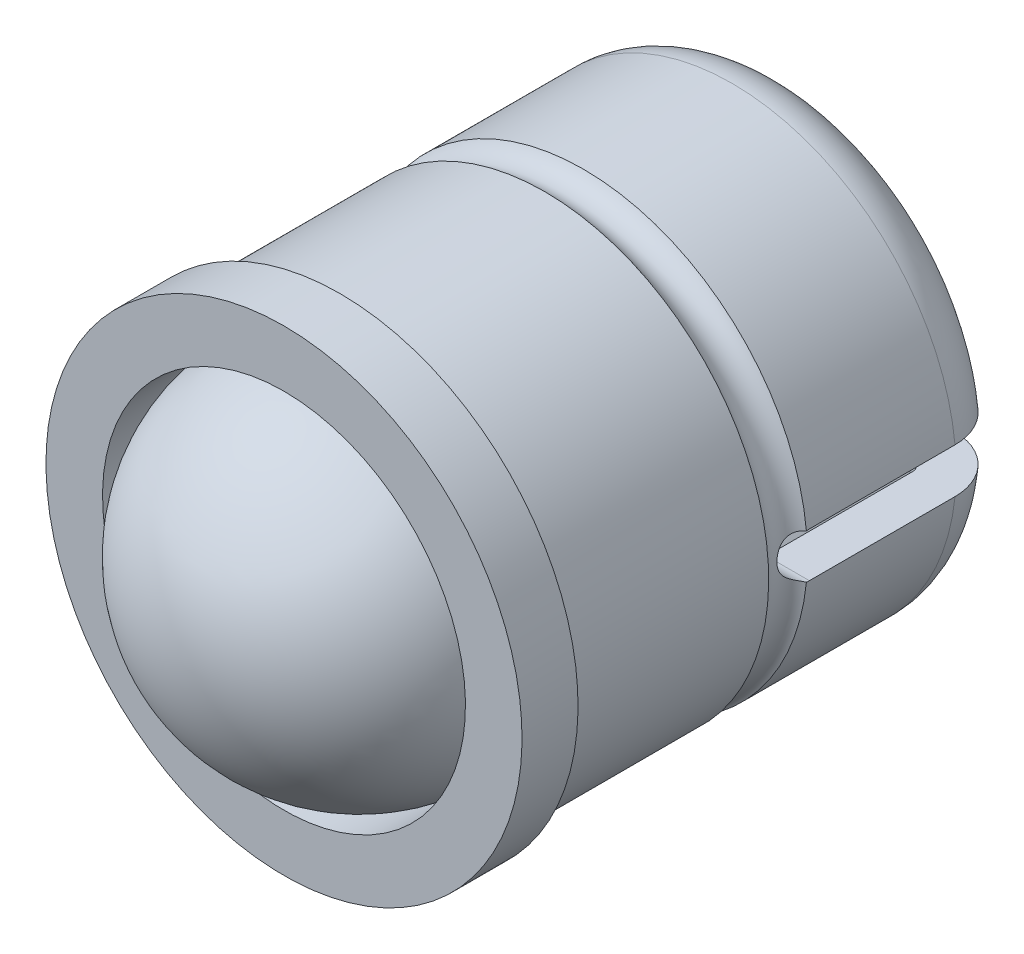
ISO-10303-21;
HEADER;
FILE_DESCRIPTION(('STEP AP214'),'2;1');
FILE_NAME('part.step','',(''),(''),'','','');
FILE_SCHEMA(('AUTOMOTIVE_DESIGN { 1 0 10303 214 1 1 1 1 }'));
ENDSEC;
DATA;
#1=APPLICATION_CONTEXT('core data for automotive mechanical design processes');
#2=APPLICATION_PROTOCOL_DEFINITION('international standard','automotive_design',2000,#1);
#3=PRODUCT_CONTEXT('',#1,'mechanical');
#4=PRODUCT('Part','Part','',(#3));
#5=PRODUCT_RELATED_PRODUCT_CATEGORY('part','',(#4));
#6=PRODUCT_DEFINITION_FORMATION('','',#4);
#7=PRODUCT_DEFINITION_CONTEXT('part definition',#1,'design');
#8=PRODUCT_DEFINITION('design','',#6,#7);
#9=PRODUCT_DEFINITION_SHAPE('','',#8);
#10=(LENGTH_UNIT() NAMED_UNIT(*) SI_UNIT(.MILLI.,.METRE.));
#11=(NAMED_UNIT(*) PLANE_ANGLE_UNIT() SI_UNIT($,.RADIAN.));
#12=(NAMED_UNIT(*) SI_UNIT($,.STERADIAN.) SOLID_ANGLE_UNIT());
#13=UNCERTAINTY_MEASURE_WITH_UNIT(LENGTH_MEASURE(1.E-05),#10,'distance_accuracy_value','');
#14=(GEOMETRIC_REPRESENTATION_CONTEXT(3) GLOBAL_UNCERTAINTY_ASSIGNED_CONTEXT((#13)) GLOBAL_UNIT_ASSIGNED_CONTEXT((#10,
#11,#12)) REPRESENTATION_CONTEXT('',''));
#15=CARTESIAN_POINT('',(0.,0.,0.));
#16=DIRECTION('',(0.,0.,1.));
#17=DIRECTION('',(1.,0.,0.));
#18=AXIS2_PLACEMENT_3D('',#15,#16,#17);
#19=CARTESIAN_POINT('',(0.,0.,1.));
#20=DIRECTION('',(0.,0.,-1.));
#21=DIRECTION('',(0.,1.,0.));
#22=AXIS2_PLACEMENT_3D('',#19,#20,#21);
#23=CYLINDRICAL_SURFACE('',#22,3.24);
#24=CARTESIAN_POINT('',(0.,0.,-7.));
#25=DIRECTION('',(0.,0.,-1.));
#26=DIRECTION('',(0.,1.,0.));
#27=AXIS2_PLACEMENT_3D('',#24,#25,#26);
#28=CIRCLE('',#27,3.24);
#29=CARTESIAN_POINT('',(-3.21521383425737,-0.4,-7.));
#30=VERTEX_POINT('',#29);
#31=CARTESIAN_POINT('',(3.21521383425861,-0.4,-6.99999999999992));
#32=VERTEX_POINT('',#31);
#33=EDGE_CURVE('E402',#30,#32,#28,.F.);
#34=ORIENTED_EDGE('',*,*,#33,.F.);
#35=DIRECTION('',(0.,0.,1.));
#36=VECTOR('',#35,1.);
#37=CARTESIAN_POINT('',(-3.21521383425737,-0.4,-4.4));
#38=LINE('',#37,#36);
#39=CARTESIAN_POINT('',(-3.21521383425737,-0.4,-4.4));
#40=VERTEX_POINT('',#39);
#41=EDGE_CURVE('E303',#40,#30,#38,.F.);
#42=ORIENTED_EDGE('',*,*,#41,.F.);
#43=CARTESIAN_POINT('',(-3.21521383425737,0.4,-4.4));
#44=CARTESIAN_POINT('',(-3.21520473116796,0.400019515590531,-4.37758775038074));
#45=CARTESIAN_POINT('',(-3.21544792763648,0.39811755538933,-4.35518315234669));
#46=CARTESIAN_POINT('',(-3.2163712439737,0.390616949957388,-4.31103385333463));
#47=CARTESIAN_POINT('',(-3.21705090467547,0.385022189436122,-4.28928848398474));
#48=CARTESIAN_POINT('',(-3.21878002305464,0.370279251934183,-4.24704556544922));
#49=CARTESIAN_POINT('',(-3.21982960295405,0.361129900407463,-4.22654843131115));
#50=CARTESIAN_POINT('',(-3.22217708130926,0.339548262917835,-4.1873814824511));
#51=CARTESIAN_POINT('',(-3.22347495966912,0.32711624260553,-4.1687115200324));
#52=CARTESIAN_POINT('',(-3.22618130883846,0.299249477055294,-4.13362795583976));
#53=CARTESIAN_POINT('',(-3.22759027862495,0.283800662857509,-4.11722556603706));
#54=CARTESIAN_POINT('',(-3.2303555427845,0.250367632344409,-4.08723750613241));
#55=CARTESIAN_POINT('',(-3.23171182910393,0.232383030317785,-4.07365226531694));
#56=CARTESIAN_POINT('',(-3.23422396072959,0.194318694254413,-4.04964570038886));
#57=CARTESIAN_POINT('',(-3.23537915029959,0.17423243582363,-4.03923464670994));
#58=CARTESIAN_POINT('',(-3.23735330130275,0.132581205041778,-4.0219383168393));
#59=CARTESIAN_POINT('',(-3.23817229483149,0.111016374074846,-4.01505270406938));
#60=CARTESIAN_POINT('',(-3.23937831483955,0.0671355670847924,-4.00503582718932));
#61=CARTESIAN_POINT('',(-3.23976751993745,0.0448239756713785,-4.00188562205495));
#62=CARTESIAN_POINT('',(-3.24007755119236,-1.4889975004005E-05,-3.9993702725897));
#63=CARTESIAN_POINT('',(-3.23999838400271,-0.0225421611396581,-4.00000507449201));
#64=CARTESIAN_POINT('',(-3.23938233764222,-0.0670428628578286,-4.00502666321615));
#65=CARTESIAN_POINT('',(-3.23884795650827,-0.0890186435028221,-4.00939297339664));
#66=CARTESIAN_POINT('',(-3.23738434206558,-0.131923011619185,-4.02172160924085));
#67=CARTESIAN_POINT('',(-3.23645510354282,-0.152851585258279,-4.02968398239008));
#68=CARTESIAN_POINT('',(-3.23430186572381,-0.193131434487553,-4.04900072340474));
#69=CARTESIAN_POINT('',(-3.2330770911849,-0.212478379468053,-4.06036403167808));
#70=CARTESIAN_POINT('',(-3.2304699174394,-0.248997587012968,-4.08615304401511));
#71=CARTESIAN_POINT('',(-3.22908751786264,-0.266169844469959,-4.10057875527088));
#72=CARTESIAN_POINT('',(-3.22630904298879,-0.29797132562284,-4.13219575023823));
#73=CARTESIAN_POINT('',(-3.22491293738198,-0.312583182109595,-4.14940450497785));
#74=CARTESIAN_POINT('',(-3.22227303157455,-0.338717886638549,-4.18604526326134));
#75=CARTESIAN_POINT('',(-3.22102927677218,-0.350239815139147,-4.20547792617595));
#76=CARTESIAN_POINT('',(-3.21883426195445,-0.369869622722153,-4.24603620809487));
#77=CARTESIAN_POINT('',(-3.21788329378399,-0.377974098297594,-4.26716349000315));
#78=CARTESIAN_POINT('',(-3.21638805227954,-0.390499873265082,-4.31046798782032));
#79=CARTESIAN_POINT('',(-3.21584316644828,-0.394926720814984,-4.33264356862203));
#80=CARTESIAN_POINT('',(-3.21531834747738,-0.399156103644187,-4.36995817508));
#81=CARTESIAN_POINT('',(-3.21521073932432,-0.40000737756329,-4.38498258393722));
#82=CARTESIAN_POINT('',(-3.21521383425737,-0.4,-4.4));
#83=B_SPLINE_CURVE_WITH_KNOTS('',3,(#43,#44,#45,#46,#47,#48,#49,#50,#51,#52,#53,#54,#55,#56,#57,
#58,#59,#60,#61,#62,#63,#64,#65,#66,#67,#68,#69,#70,#71,#72,#73,#74,#75,#76,#77,#78,#79,#80,#81,
#82),.UNSPECIFIED.,.F.,.F.,(4,2,2,2,2,2,2,2,2,2,2,2,2,2,2,2,2,2,2,4),(0.,0.0671435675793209,
0.134216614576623,0.201311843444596,0.268401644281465,0.335812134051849,0.403232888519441,
0.470869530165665,0.53849971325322,0.605785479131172,0.673070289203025,0.739988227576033,
0.806907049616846,0.874003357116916,0.941099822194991,1.0086351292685,1.07619051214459,
1.14381301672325,1.2113333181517,1.25638017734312),.UNSPECIFIED.);
#84=CARTESIAN_POINT('',(-3.21521383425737,0.4,-4.4));
#85=VERTEX_POINT('',#84);
#86=EDGE_CURVE('E183',#85,#40,#83,.T.);
#87=ORIENTED_EDGE('',*,*,#86,.F.);
#88=DIRECTION('',(0.,0.,-1.));
#89=VECTOR('',#88,1.);
#90=CARTESIAN_POINT('',(-3.21521383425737,0.4,-8.));
#91=LINE('',#90,#89);
#92=CARTESIAN_POINT('',(-3.21521383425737,0.4,-7.));
#93=VERTEX_POINT('',#92);
#94=EDGE_CURVE('E98',#93,#85,#91,.F.);
#95=ORIENTED_EDGE('',*,*,#94,.F.);
#96=CARTESIAN_POINT('',(0.,0.,-7.));
#97=DIRECTION('',(0.,0.,-1.));
#98=DIRECTION('',(0.,1.,0.));
#99=AXIS2_PLACEMENT_3D('',#96,#97,#98);
#100=CIRCLE('',#99,3.24);
#101=CARTESIAN_POINT('',(3.21521383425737,0.4,-7.));
#102=VERTEX_POINT('',#101);
#103=EDGE_CURVE('E217',#102,#93,#100,.F.);
#104=ORIENTED_EDGE('',*,*,#103,.F.);
#105=DIRECTION('',(0.,0.,-1.));
#106=VECTOR('',#105,1.);
#107=CARTESIAN_POINT('',(3.21521383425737,0.4,-8.));
#108=LINE('',#107,#106);
#109=CARTESIAN_POINT('',(3.21521383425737,0.4,-4.4));
#110=VERTEX_POINT('',#109);
#111=EDGE_CURVE('E321',#110,#102,#108,.T.);
#112=ORIENTED_EDGE('',*,*,#111,.F.);
#113=CARTESIAN_POINT('',(3.21521383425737,-0.4,-4.4));
#114=CARTESIAN_POINT('',(3.21520473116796,-0.400019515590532,-4.37758775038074));
#115=CARTESIAN_POINT('',(3.21544792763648,-0.398117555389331,-4.35518315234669));
#116=CARTESIAN_POINT('',(3.2163712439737,-0.390616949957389,-4.31103385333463));
#117=CARTESIAN_POINT('',(3.21705090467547,-0.385022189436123,-4.28928848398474));
#118=CARTESIAN_POINT('',(3.21878002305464,-0.370279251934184,-4.24704556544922));
#119=CARTESIAN_POINT('',(3.21982960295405,-0.361129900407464,-4.22654843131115));
#120=CARTESIAN_POINT('',(3.22217708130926,-0.339548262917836,-4.1873814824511));
#121=CARTESIAN_POINT('',(3.22347495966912,-0.327116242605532,-4.1687115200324));
#122=CARTESIAN_POINT('',(3.22618130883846,-0.299249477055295,-4.13362795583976));
#123=CARTESIAN_POINT('',(3.22759027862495,-0.283800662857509,-4.11722556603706));
#124=CARTESIAN_POINT('',(3.2303555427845,-0.250367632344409,-4.08723750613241));
#125=CARTESIAN_POINT('',(3.23171182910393,-0.232383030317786,-4.07365226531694));
#126=CARTESIAN_POINT('',(3.23422396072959,-0.194318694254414,-4.04964570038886));
#127=CARTESIAN_POINT('',(3.23537915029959,-0.174232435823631,-4.03923464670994));
#128=CARTESIAN_POINT('',(3.23735330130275,-0.132581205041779,-4.0219383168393));
#129=CARTESIAN_POINT('',(3.23817229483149,-0.111016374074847,-4.01505270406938));
#130=CARTESIAN_POINT('',(3.23937831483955,-0.0671355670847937,-4.00503582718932));
#131=CARTESIAN_POINT('',(3.23976751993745,-0.0448239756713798,-4.00188562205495));
#132=CARTESIAN_POINT('',(3.24007755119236,1.48899750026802E-05,-3.9993702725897));
#133=CARTESIAN_POINT('',(3.23999838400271,0.0225421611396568,-4.00000507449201));
#134=CARTESIAN_POINT('',(3.23938233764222,0.0670428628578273,-4.00502666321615));
#135=CARTESIAN_POINT('',(3.23884795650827,0.0890186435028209,-4.00939297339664));
#136=CARTESIAN_POINT('',(3.23738434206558,0.131923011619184,-4.02172160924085));
#137=CARTESIAN_POINT('',(3.23645510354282,0.152851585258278,-4.02968398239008));
#138=CARTESIAN_POINT('',(3.23430186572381,0.193131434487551,-4.04900072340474));
#139=CARTESIAN_POINT('',(3.2330770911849,0.212478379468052,-4.06036403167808));
#140=CARTESIAN_POINT('',(3.2304699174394,0.248997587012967,-4.08615304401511));
#141=CARTESIAN_POINT('',(3.22908751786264,0.266169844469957,-4.10057875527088));
#142=CARTESIAN_POINT('',(3.22630904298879,0.297971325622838,-4.13219575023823));
#143=CARTESIAN_POINT('',(3.22491293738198,0.312583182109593,-4.14940450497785));
#144=CARTESIAN_POINT('',(3.22227303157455,0.338717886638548,-4.18604526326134));
#145=CARTESIAN_POINT('',(3.22102927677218,0.350239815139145,-4.20547792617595));
#146=CARTESIAN_POINT('',(3.21883426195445,0.369869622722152,-4.24603620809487));
#147=CARTESIAN_POINT('',(3.21788329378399,0.377974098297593,-4.26716349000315));
#148=CARTESIAN_POINT('',(3.21638805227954,0.39049987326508,-4.31046798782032));
#149=CARTESIAN_POINT('',(3.21584316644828,0.394926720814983,-4.33264356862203));
#150=CARTESIAN_POINT('',(3.21531834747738,0.399156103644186,-4.36995817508));
#151=CARTESIAN_POINT('',(3.21521073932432,0.400007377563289,-4.38498258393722));
#152=CARTESIAN_POINT('',(3.21521383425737,0.4,-4.4));
#153=B_SPLINE_CURVE_WITH_KNOTS('',3,(#113,#114,#115,#116,#117,#118,#119,#120,#121,#122,#123,
#124,#125,#126,#127,#128,#129,#130,#131,#132,#133,#134,#135,#136,#137,#138,#139,#140,#141,#142,
#143,#144,#145,#146,#147,#148,#149,#150,#151,#152),.UNSPECIFIED.,.F.,.F.,(4,2,2,2,2,2,2,2,2,2,2,
2,2,2,2,2,2,2,2,4),(0.,0.0671435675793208,0.134216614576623,0.201311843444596,0.268401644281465,
0.335812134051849,0.403232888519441,0.470869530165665,0.538499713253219,0.605785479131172,
0.673070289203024,0.739988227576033,0.806907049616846,0.874003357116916,0.941099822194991,
1.0086351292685,1.07619051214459,1.14381301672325,1.2113333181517,1.25638017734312),.UNSPECIFIED.);
#154=CARTESIAN_POINT('',(3.21521383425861,-0.4,-4.4));
#155=VERTEX_POINT('',#154);
#156=EDGE_CURVE('E174',#155,#110,#153,.T.);
#157=ORIENTED_EDGE('',*,*,#156,.F.);
#158=DIRECTION('',(0.,0.,1.));
#159=VECTOR('',#158,1.);
#160=CARTESIAN_POINT('',(3.21521383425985,-0.4,-4.4));
#161=LINE('',#160,#159);
#162=EDGE_CURVE('E300',#32,#155,#161,.T.);
#163=ORIENTED_EDGE('',*,*,#162,.F.);
#164=EDGE_LOOP('',(#34,#42,#87,#95,#104,#112,#157,#163));
#165=FACE_BOUND('',#164,.T.);
#166=CARTESIAN_POINT('',(0.,0.,-0.604754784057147));
#167=DIRECTION('',(0.,0.,1.));
#168=DIRECTION('',(1.,0.,0.));
#169=AXIS2_PLACEMENT_3D('',#166,#167,#168);
#170=CIRCLE('',#169,3.24);
#171=CARTESIAN_POINT('',(3.24,0.,-0.604754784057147));
#172=VERTEX_POINT('',#171);
#173=EDGE_CURVE('E9',#172,#172,#170,.F.);
#174=ORIENTED_EDGE('',*,*,#173,.F.);
#175=EDGE_LOOP('',(#174));
#176=FACE_BOUND('',#175,.T.);
#177=ADVANCED_FACE('F14',(#165,#176),#23,.F.);
#178=CARTESIAN_POINT('',(0.,0.,1.));
#179=DIRECTION('',(0.,0.,-1.));
#180=DIRECTION('',(0.,1.,0.));
#181=AXIS2_PLACEMENT_3D('',#178,#179,#180);
#182=CIRCLE('',#181,3.24);
#183=CARTESIAN_POINT('',(0.,3.24,1.));
#184=VERTEX_POINT('',#183);
#185=EDGE_CURVE('E189',#184,#184,#182,.F.);
#186=ORIENTED_EDGE('',*,*,#185,.T.);
#187=EDGE_LOOP('',(#186));
#188=FACE_BOUND('',#187,.T.);
#189=CARTESIAN_POINT('',(0.,0.,-0.0952452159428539));
#190=DIRECTION('',(0.,0.,-1.));
#191=DIRECTION('',(-1.,0.,0.));
#192=AXIS2_PLACEMENT_3D('',#189,#190,#191);
#193=CIRCLE('',#192,3.24);
#194=CARTESIAN_POINT('',(-3.24,0.,-0.0952452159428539));
#195=VERTEX_POINT('',#194);
#196=EDGE_CURVE('E23',#195,#195,#193,.F.);
#197=ORIENTED_EDGE('',*,*,#196,.F.);
#198=EDGE_LOOP('',(#197));
#199=FACE_BOUND('',#198,.T.);
#200=ADVANCED_FACE('F195',(#188,#199),#23,.F.);
#201=CARTESIAN_POINT('',(0.,0.,-7.));
#202=DIRECTION('',(0.,0.,1.));
#203=DIRECTION('',(0.,-1.,0.));
#204=AXIS2_PLACEMENT_3D('',#201,#202,#203);
#205=TOROIDAL_SURFACE('',#204,3.04,0.2);
#206=CARTESIAN_POINT('',(0.,0.,-7.2));
#207=DIRECTION('',(0.,0.,-1.));
#208=DIRECTION('',(-0.991305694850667,0.131578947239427,0.));
#209=AXIS2_PLACEMENT_3D('',#206,#207,#208);
#210=CIRCLE('',#209,3.04000000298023);
#211=CARTESIAN_POINT('',(-3.01356931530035,0.4,-7.2));
#212=VERTEX_POINT('',#211);
#213=CARTESIAN_POINT('',(3.01356931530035,0.4,-7.2));
#214=VERTEX_POINT('',#213);
#215=EDGE_CURVE('E477',#212,#214,#210,.T.);
#216=ORIENTED_EDGE('',*,*,#215,.T.);
#217=CARTESIAN_POINT('',(3.21521383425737,0.4,-7.));
#218=CARTESIAN_POINT('',(3.21522372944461,0.400000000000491,-7.01118816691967));
#219=CARTESIAN_POINT('',(3.21426839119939,0.400000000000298,-7.02237299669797));
#220=CARTESIAN_POINT('',(3.2105008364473,0.399999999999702,-7.04441446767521));
#221=CARTESIAN_POINT('',(3.20769046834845,0.399999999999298,-7.05527142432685));
#222=CARTESIAN_POINT('',(3.20028465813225,0.399999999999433,-7.07636345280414));
#223=CARTESIAN_POINT('',(3.1956884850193,0.399999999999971,-7.08659826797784));
#224=CARTESIAN_POINT('',(3.1848497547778,0.400000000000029,-7.10615320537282));
#225=CARTESIAN_POINT('',(3.17860739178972,0.399999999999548,-7.11547343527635));
#226=CARTESIAN_POINT('',(3.16463302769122,0.399999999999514,-7.13297127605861));
#227=CARTESIAN_POINT('',(3.15689616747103,0.399999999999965,-7.1411450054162));
#228=CARTESIAN_POINT('',(3.14016852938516,0.400000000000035,-7.15608917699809));
#229=CARTESIAN_POINT('',(3.13117769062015,0.399999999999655,-7.16285955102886));
#230=CARTESIAN_POINT('',(3.11212633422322,0.399999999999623,-7.17485923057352));
#231=CARTESIAN_POINT('',(3.10205824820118,0.399999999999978,-7.18007650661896));
#232=CARTESIAN_POINT('',(3.08119521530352,0.400000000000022,-7.1887590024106));
#233=CARTESIAN_POINT('',(3.07040060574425,0.399999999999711,-7.19222502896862));
#234=CARTESIAN_POINT('',(3.05188626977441,0.39999999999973,-7.19650839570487));
#235=CARTESIAN_POINT('',(3.04427642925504,0.399999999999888,-7.19781705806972));
#236=CARTESIAN_POINT('',(3.02896846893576,0.400000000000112,-7.19956278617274));
#237=CARTESIAN_POINT('',(3.02127049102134,0.400000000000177,-7.20000109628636));
#238=CARTESIAN_POINT('',(3.01356931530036,0.4,-7.2));
#239=B_SPLINE_CURVE_WITH_KNOTS('',3,(#217,#218,#219,#220,#221,#222,#223,#224,#225,#226,#227,
#228,#229,#230,#231,#232,#233,#234,#235,#236,#237,#238),.UNSPECIFIED.,.F.,.F.,(4,2,2,2,2,2,2,2,
2,2,4),(0.,0.0335189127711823,0.067004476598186,0.100503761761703,0.133999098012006,
0.167605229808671,0.201212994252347,0.235074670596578,0.268920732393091,0.292038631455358,
0.315123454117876),.UNSPECIFIED.);
#240=EDGE_CURVE('E324',#102,#214,#239,.T.);
#241=ORIENTED_EDGE('',*,*,#240,.F.);
#242=ORIENTED_EDGE('',*,*,#103,.T.);
#243=CARTESIAN_POINT('',(-3.01356931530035,0.4,-7.2));
#244=CARTESIAN_POINT('',(-3.02498407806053,0.400000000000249,-7.20000927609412));
#245=CARTESIAN_POINT('',(-3.03639672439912,0.400000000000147,-7.19904022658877));
#246=CARTESIAN_POINT('',(-3.0588947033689,0.399999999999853,-7.19521188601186));
#247=CARTESIAN_POINT('',(-3.06998020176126,0.399999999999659,-7.19235356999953));
#248=CARTESIAN_POINT('',(-3.09151956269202,0.399999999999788,-7.18481076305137));
#249=CARTESIAN_POINT('',(-3.10197304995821,0.40000000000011,-7.18012519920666));
#250=CARTESIAN_POINT('',(-3.12193793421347,0.39999999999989,-7.16905977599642));
#251=CARTESIAN_POINT('',(-3.13144957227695,0.399999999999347,-7.16268035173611));
#252=CARTESIAN_POINT('',(-3.14921827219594,0.399999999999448,-7.14843310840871));
#253=CARTESIAN_POINT('',(-3.15748043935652,0.400000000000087,-7.1405716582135));
#254=CARTESIAN_POINT('',(-3.17255453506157,0.399999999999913,-7.12356360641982));
#255=CARTESIAN_POINT('',(-3.17936658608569,0.399999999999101,-7.11441711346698));
#256=CARTESIAN_POINT('',(-3.19129280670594,0.399999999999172,-7.09517332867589));
#257=CARTESIAN_POINT('',(-3.19641931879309,0.400000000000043,-7.085083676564));
#258=CARTESIAN_POINT('',(-3.20488941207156,0.399999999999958,-7.06418523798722));
#259=CARTESIAN_POINT('',(-3.20823423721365,0.399999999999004,-7.05337695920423));
#260=CARTESIAN_POINT('',(-3.21215956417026,0.399999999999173,-7.03541185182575));
#261=CARTESIAN_POINT('',(-3.21330424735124,0.399999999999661,-7.02837329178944));
#262=CARTESIAN_POINT('',(-3.21483122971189,0.400000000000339,-7.01422419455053));
#263=CARTESIAN_POINT('',(-3.21521462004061,0.400000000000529,-7.00711377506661));
#264=CARTESIAN_POINT('',(-3.21521383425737,0.4,-7.));
#265=B_SPLINE_CURVE_WITH_KNOTS('',3,(#243,#244,#245,#246,#247,#248,#249,#250,#251,#252,#253,
#254,#255,#256,#257,#258,#259,#260,#261,#262,#263,#264),.UNSPECIFIED.,.F.,.F.,(4,2,2,2,2,2,2,2,
2,2,4),(0.,0.0342003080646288,0.0683829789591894,0.102585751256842,0.136779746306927,
0.170830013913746,0.204877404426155,0.23866961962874,0.272438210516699,0.293793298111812,
0.315117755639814),.UNSPECIFIED.);
#266=EDGE_CURVE('E330',#212,#93,#265,.T.);
#267=ORIENTED_EDGE('',*,*,#266,.F.);
#268=EDGE_LOOP('',(#216,#241,#242,#267));
#269=FACE_BOUND('',#268,.T.);
#270=ADVANCED_FACE('F363',(#269),#205,.F.);
#271=CARTESIAN_POINT('',(0.,0.,-7.));
#272=DIRECTION('',(0.,0.,1.));
#273=DIRECTION('',(0.,-1.,0.));
#274=AXIS2_PLACEMENT_3D('',#271,#272,#273);
#275=TOROIDAL_SURFACE('',#274,3.04,0.2);
#276=ORIENTED_EDGE('',*,*,#33,.T.);
#277=CARTESIAN_POINT('',(3.01356931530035,-0.4,-7.2));
#278=CARTESIAN_POINT('',(3.02498407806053,-0.400000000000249,-7.20000927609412));
#279=CARTESIAN_POINT('',(3.03639672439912,-0.400000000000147,-7.19904022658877));
#280=CARTESIAN_POINT('',(3.0588947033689,-0.399999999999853,-7.19521188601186));
#281=CARTESIAN_POINT('',(3.06998020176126,-0.39999999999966,-7.19235356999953));
#282=CARTESIAN_POINT('',(3.09151956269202,-0.399999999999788,-7.18481076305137));
#283=CARTESIAN_POINT('',(3.10197304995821,-0.400000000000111,-7.18012519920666));
#284=CARTESIAN_POINT('',(3.12193793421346,-0.399999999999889,-7.16905977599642));
#285=CARTESIAN_POINT('',(3.13144957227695,-0.399999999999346,-7.16268035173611));
#286=CARTESIAN_POINT('',(3.14921827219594,-0.399999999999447,-7.14843310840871));
#287=CARTESIAN_POINT('',(3.15748043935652,-0.400000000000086,-7.1405716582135));
#288=CARTESIAN_POINT('',(3.17255453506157,-0.399999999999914,-7.12356360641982));
#289=CARTESIAN_POINT('',(3.17936658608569,-0.399999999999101,-7.11441711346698));
#290=CARTESIAN_POINT('',(3.19129280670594,-0.399999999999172,-7.09517332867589));
#291=CARTESIAN_POINT('',(3.19641931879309,-0.400000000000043,-7.085083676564));
#292=CARTESIAN_POINT('',(3.20488941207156,-0.399999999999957,-7.06418523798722));
#293=CARTESIAN_POINT('',(3.20823423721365,-0.399999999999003,-7.05337695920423));
#294=CARTESIAN_POINT('',(3.21215956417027,-0.399999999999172,-7.03541185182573));
#295=CARTESIAN_POINT('',(3.21330424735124,-0.399999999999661,-7.02837329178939));
#296=CARTESIAN_POINT('',(3.2148312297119,-0.400000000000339,-7.01422419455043));
#297=CARTESIAN_POINT('',(3.21521462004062,-0.400000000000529,-7.00711377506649));
#298=CARTESIAN_POINT('',(3.21521383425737,-0.4,-6.99999999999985));
#299=B_SPLINE_CURVE_WITH_KNOTS('',3,(#277,#278,#279,#280,#281,#282,#283,#284,#285,#286,#287,
#288,#289,#290,#291,#292,#293,#294,#295,#296,#297,#298),.UNSPECIFIED.,.F.,.F.,(4,2,2,2,2,2,2,2,
2,2,4),(0.,0.0342003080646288,0.0683829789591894,0.102585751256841,0.136779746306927,
0.170830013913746,0.204877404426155,0.23866961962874,0.272438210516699,0.293793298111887,
0.315117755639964),.UNSPECIFIED.);
#300=CARTESIAN_POINT('',(3.01356931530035,-0.4,-7.2));
#301=VERTEX_POINT('',#300);
#302=EDGE_CURVE('E312',#301,#32,#299,.T.);
#303=ORIENTED_EDGE('',*,*,#302,.F.);
#304=CARTESIAN_POINT('',(0.,0.,-7.2));
#305=DIRECTION('',(0.,0.,-1.));
#306=DIRECTION('',(0.991305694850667,-0.13157894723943,0.));
#307=AXIS2_PLACEMENT_3D('',#304,#305,#306);
#308=CIRCLE('',#307,3.04000000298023);
#309=CARTESIAN_POINT('',(-3.01356931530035,-0.4,-7.2));
#310=VERTEX_POINT('',#309);
#311=EDGE_CURVE('E401',#301,#310,#308,.T.);
#312=ORIENTED_EDGE('',*,*,#311,.T.);
#313=CARTESIAN_POINT('',(-3.21521383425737,-0.4,-7.));
#314=CARTESIAN_POINT('',(-3.21522372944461,-0.400000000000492,-7.01118816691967));
#315=CARTESIAN_POINT('',(-3.21426839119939,-0.400000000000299,-7.02237299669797));
#316=CARTESIAN_POINT('',(-3.2105008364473,-0.399999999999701,-7.04441446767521));
#317=CARTESIAN_POINT('',(-3.20769046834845,-0.399999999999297,-7.05527142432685));
#318=CARTESIAN_POINT('',(-3.20028465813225,-0.399999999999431,-7.07636345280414));
#319=CARTESIAN_POINT('',(-3.1956884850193,-0.399999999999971,-7.08659826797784));
#320=CARTESIAN_POINT('',(-3.1848497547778,-0.400000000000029,-7.10615320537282));
#321=CARTESIAN_POINT('',(-3.17860739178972,-0.399999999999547,-7.11547343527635));
#322=CARTESIAN_POINT('',(-3.16463302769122,-0.399999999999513,-7.13297127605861));
#323=CARTESIAN_POINT('',(-3.15689616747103,-0.399999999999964,-7.1411450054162));
#324=CARTESIAN_POINT('',(-3.14016852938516,-0.400000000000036,-7.15608917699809));
#325=CARTESIAN_POINT('',(-3.13117769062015,-0.399999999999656,-7.16285955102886));
#326=CARTESIAN_POINT('',(-3.11212633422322,-0.399999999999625,-7.17485923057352));
#327=CARTESIAN_POINT('',(-3.10205824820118,-0.399999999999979,-7.18007650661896));
#328=CARTESIAN_POINT('',(-3.08119521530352,-0.400000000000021,-7.1887590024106));
#329=CARTESIAN_POINT('',(-3.07040060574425,-0.39999999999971,-7.19222502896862));
#330=CARTESIAN_POINT('',(-3.05188626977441,-0.399999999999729,-7.19650839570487));
#331=CARTESIAN_POINT('',(-3.04427642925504,-0.399999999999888,-7.19781705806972));
#332=CARTESIAN_POINT('',(-3.02896846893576,-0.400000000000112,-7.19956278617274));
#333=CARTESIAN_POINT('',(-3.02127049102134,-0.400000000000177,-7.20000109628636));
#334=CARTESIAN_POINT('',(-3.01356931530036,-0.4,-7.2));
#335=B_SPLINE_CURVE_WITH_KNOTS('',3,(#313,#314,#315,#316,#317,#318,#319,#320,#321,#322,#323,
#324,#325,#326,#327,#328,#329,#330,#331,#332,#333,#334),.UNSPECIFIED.,.F.,.F.,(4,2,2,2,2,2,2,2,
2,2,4),(0.,0.0335189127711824,0.0670044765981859,0.100503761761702,0.133999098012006,
0.167605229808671,0.201212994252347,0.235074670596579,0.268920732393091,0.292038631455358,
0.315123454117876),.UNSPECIFIED.);
#336=EDGE_CURVE('E306',#30,#310,#335,.T.);
#337=ORIENTED_EDGE('',*,*,#336,.F.);
#338=EDGE_LOOP('',(#276,#303,#312,#337));
#339=FACE_BOUND('',#338,.T.);
#340=ADVANCED_FACE('F357',(#339),#275,.F.);
#341=CARTESIAN_POINT('',(3.04,0.,-7.2));
#342=DIRECTION('',(0.,0.,-1.));
#343=DIRECTION('',(0.,1.,0.));
#344=AXIS2_PLACEMENT_3D('',#341,#342,#343);
#345=PLANE('',#344);
#346=ORIENTED_EDGE('',*,*,#311,.F.);
#347=DIRECTION('',(1.,0.,0.));
#348=VECTOR('',#347,1.);
#349=CARTESIAN_POINT('',(4.25,-0.4,-7.2));
#350=LINE('',#349,#348);
#351=EDGE_CURVE('E309',#310,#301,#350,.T.);
#352=ORIENTED_EDGE('',*,*,#351,.F.);
#353=EDGE_LOOP('',(#346,#352));
#354=FACE_BOUND('',#353,.T.);
#355=ADVANCED_FACE('F362',(#354),#345,.F.);
#356=CARTESIAN_POINT('',(0.,0.,-8.));
#357=DIRECTION('',(0.,0.,1.));
#358=DIRECTION('',(0.,-1.,0.));
#359=AXIS2_PLACEMENT_3D('',#356,#357,#358);
#360=PLANE('',#359);
#361=CARTESIAN_POINT('',(0.,0.,-8.));
#362=DIRECTION('',(0.,0.,1.));
#363=DIRECTION('',(-0.991071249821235,-0.133333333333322,0.));
#364=AXIS2_PLACEMENT_3D('',#361,#362,#363);
#365=CIRCLE('',#364,3.00000000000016);
#366=CARTESIAN_POINT('',(-2.97321374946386,-0.4,-8.));
#367=VERTEX_POINT('',#366);
#368=CARTESIAN_POINT('',(2.97321374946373,-0.4,-8.));
#369=VERTEX_POINT('',#368);
#370=EDGE_CURVE('E319',#367,#369,#365,.T.);
#371=ORIENTED_EDGE('',*,*,#370,.F.);
#372=DIRECTION('',(1.,0.,0.));
#373=VECTOR('',#372,1.);
#374=CARTESIAN_POINT('',(4.25,-0.4,-8.));
#375=LINE('',#374,#373);
#376=EDGE_CURVE('E279',#369,#367,#375,.F.);
#377=ORIENTED_EDGE('',*,*,#376,.F.);
#378=EDGE_LOOP('',(#371,#377));
#379=FACE_BOUND('',#378,.T.);
#380=ADVANCED_FACE('F409',(#379),#360,.F.);
#381=CARTESIAN_POINT('',(3.04,0.,-7.2));
#382=DIRECTION('',(0.,0.,-1.));
#383=DIRECTION('',(0.,1.,0.));
#384=AXIS2_PLACEMENT_3D('',#381,#382,#383);
#385=PLANE('',#384);
#386=ORIENTED_EDGE('',*,*,#215,.F.);
#387=DIRECTION('',(1.,0.,0.));
#388=VECTOR('',#387,1.);
#389=CARTESIAN_POINT('',(4.25,0.4,-7.2));
#390=LINE('',#389,#388);
#391=EDGE_CURVE('E327',#214,#212,#390,.F.);
#392=ORIENTED_EDGE('',*,*,#391,.F.);
#393=EDGE_LOOP('',(#386,#392));
#394=FACE_BOUND('',#393,.T.);
#395=ADVANCED_FACE('F197',(#394),#385,.F.);
#396=CARTESIAN_POINT('',(0.,0.,-8.));
#397=DIRECTION('',(0.,0.,1.));
#398=DIRECTION('',(0.,-1.,0.));
#399=AXIS2_PLACEMENT_3D('',#396,#397,#398);
#400=PLANE('',#399);
#401=CARTESIAN_POINT('',(0.,0.,-8.));
#402=DIRECTION('',(0.,0.,1.));
#403=DIRECTION('',(0.991071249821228,0.133333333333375,0.));
#404=AXIS2_PLACEMENT_3D('',#401,#402,#403);
#405=CIRCLE('',#404,2.99999999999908);
#406=CARTESIAN_POINT('',(2.97321374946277,0.4,-8.));
#407=VERTEX_POINT('',#406);
#408=CARTESIAN_POINT('',(-2.97321374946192,0.400000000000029,-8.));
#409=VERTEX_POINT('',#408);
#410=EDGE_CURVE('E72',#407,#409,#405,.T.);
#411=ORIENTED_EDGE('',*,*,#410,.F.);
#412=DIRECTION('',(1.,0.,0.));
#413=VECTOR('',#412,1.);
#414=CARTESIAN_POINT('',(4.25,0.4,-8.));
#415=LINE('',#414,#413);
#416=EDGE_CURVE('E69',#409,#407,#415,.T.);
#417=ORIENTED_EDGE('',*,*,#416,.F.);
#418=EDGE_LOOP('',(#411,#417));
#419=FACE_BOUND('',#418,.T.);
#420=ADVANCED_FACE('F74',(#419),#400,.F.);
#421=CARTESIAN_POINT('',(4.25,0.,1.));
#422=DIRECTION('',(0.,0.,-1.));
#423=DIRECTION('',(0.,1.,0.));
#424=AXIS2_PLACEMENT_3D('',#421,#422,#423);
#425=PLANE('',#424);
#426=CARTESIAN_POINT('',(0.,0.,1.));
#427=DIRECTION('',(0.,0.,-1.));
#428=DIRECTION('',(0.,1.,0.));
#429=AXIS2_PLACEMENT_3D('',#426,#427,#428);
#430=CIRCLE('',#429,4.25);
#431=CARTESIAN_POINT('',(0.,4.25,1.));
#432=VERTEX_POINT('',#431);
#433=EDGE_CURVE('E110',#432,#432,#430,.T.);
#434=ORIENTED_EDGE('',*,*,#433,.F.);
#435=EDGE_LOOP('',(#434));
#436=FACE_BOUND('',#435,.T.);
#437=ORIENTED_EDGE('',*,*,#185,.F.);
#438=EDGE_LOOP('',(#437));
#439=FACE_BOUND('',#438,.T.);
#440=ADVANCED_FACE('F204',(#436,#439),#425,.F.);
#441=CARTESIAN_POINT('',(0.,0.,-7.));
#442=DIRECTION('',(0.,0.,1.));
#443=DIRECTION('',(0.,-1.,0.));
#444=AXIS2_PLACEMENT_3D('',#441,#442,#443);
#445=TOROIDAL_SURFACE('',#444,3.,1.);
#446=ORIENTED_EDGE('',*,*,#370,.T.);
#447=CARTESIAN_POINT('',(3.97994974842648,-0.4,-7.));
#448=CARTESIAN_POINT('',(3.97994960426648,-0.4,-7.02802424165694));
#449=CARTESIAN_POINT('',(3.97876502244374,-0.4,-7.05603501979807));
#450=CARTESIAN_POINT('',(3.97403961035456,-0.4,-7.11185554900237));
#451=CARTESIAN_POINT('',(3.97049890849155,-0.4,-7.139665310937));
#452=CARTESIAN_POINT('',(3.95637803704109,-0.4,-7.22243882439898));
#453=CARTESIAN_POINT('',(3.94229899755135,-0.4,-7.27684715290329));
#454=CARTESIAN_POINT('',(3.90521055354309,-0.4,-7.38252445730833));
#455=CARTESIAN_POINT('',(3.88219720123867,-0.4,-7.4337920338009));
#456=CARTESIAN_POINT('',(3.82790536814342,-0.4,-7.53174600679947));
#457=CARTESIAN_POINT('',(3.79662806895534,-0.4,-7.57843305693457));
#458=CARTESIAN_POINT('',(3.72664883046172,-0.4,-7.66599798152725));
#459=CARTESIAN_POINT('',(3.6879328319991,-0.4,-7.70686459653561));
#460=CARTESIAN_POINT('',(3.60419227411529,-0.4,-7.78156852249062));
#461=CARTESIAN_POINT('',(3.55916752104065,-0.4,-7.81540561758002));
#462=CARTESIAN_POINT('',(3.48779643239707,-0.4,-7.8602442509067));
#463=CARTESIAN_POINT('',(3.4632832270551,-0.4,-7.8742391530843));
#464=CARTESIAN_POINT('',(3.41319521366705,-0.4,-7.90011539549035));
#465=CARTESIAN_POINT('',(3.38762137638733,-0.4,-7.91199861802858));
#466=CARTESIAN_POINT('',(3.3095395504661,-0.4,-7.94436599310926));
#467=CARTESIAN_POINT('',(3.25562841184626,-0.4,-7.96159469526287));
#468=CARTESIAN_POINT('',(3.16340096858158,-0.4,-7.98279411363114));
#469=CARTESIAN_POINT('',(3.12562576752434,-0.4,-7.98924445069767));
#470=CARTESIAN_POINT('',(3.04964529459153,-0.4,-7.99784581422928));
#471=CARTESIAN_POINT('',(3.01144073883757,-0.4,-8.00000316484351));
#472=CARTESIAN_POINT('',(2.97321374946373,-0.4,-8.));
#473=B_SPLINE_CURVE_WITH_KNOTS('',3,(#447,#448,#449,#450,#451,#452,#453,#454,#455,#456,#457,
#458,#459,#460,#461,#462,#463,#464,#465,#466,#467,#468,#469,#470,#471,#472),.UNSPECIFIED.,.F.,
.F.,(4,2,2,2,2,2,2,2,2,2,2,2,4),(0.,0.0840209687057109,0.168037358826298,0.335772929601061,
0.503582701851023,0.671368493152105,0.839474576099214,1.00758582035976,1.09217941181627,
1.17669721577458,1.34558302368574,1.46032773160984,1.57490327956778),.UNSPECIFIED.);
#474=CARTESIAN_POINT('',(3.97994974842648,-0.4,-7.));
#475=VERTEX_POINT('',#474);
#476=EDGE_CURVE('E89',#475,#369,#473,.T.);
#477=ORIENTED_EDGE('',*,*,#476,.F.);
#478=CARTESIAN_POINT('',(0.,0.,-7.));
#479=DIRECTION('',(0.,0.,-1.));
#480=DIRECTION('',(0.,1.,0.));
#481=AXIS2_PLACEMENT_3D('',#478,#479,#480);
#482=CIRCLE('',#481,4.);
#483=CARTESIAN_POINT('',(-3.97994974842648,-0.4,-7.));
#484=VERTEX_POINT('',#483);
#485=EDGE_CURVE('E236',#484,#475,#482,.F.);
#486=ORIENTED_EDGE('',*,*,#485,.F.);
#487=CARTESIAN_POINT('',(-2.97321374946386,-0.4,-8.));
#488=CARTESIAN_POINT('',(-3.03017821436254,-0.4,-8.00004261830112));
#489=CARTESIAN_POINT('',(-3.08712315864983,-0.4,-7.99522038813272));
#490=CARTESIAN_POINT('',(-3.19938395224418,-0.4,-7.97614781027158));
#491=CARTESIAN_POINT('',(-3.25470058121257,-0.4,-7.96190205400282));
#492=CARTESIAN_POINT('',(-3.36220852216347,-0.4,-7.92427110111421));
#493=CARTESIAN_POINT('',(-3.4143977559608,-0.4,-7.90087990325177));
#494=CARTESIAN_POINT('',(-3.48909394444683,-0.4,-7.85948552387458));
#495=CARTESIAN_POINT('',(-3.51339623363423,-0.4,-7.84463493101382));
#496=CARTESIAN_POINT('',(-3.56067934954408,-0.4,-7.81291271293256));
#497=CARTESIAN_POINT('',(-3.58365885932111,-0.4,-7.79603912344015));
#498=CARTESIAN_POINT('',(-3.65005145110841,-0.4,-7.74278349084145));
#499=CARTESIAN_POINT('',(-3.69125163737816,-0.4,-7.70358151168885));
#500=CARTESIAN_POINT('',(-3.76642250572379,-0.4,-7.61877211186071));
#501=CARTESIAN_POINT('',(-3.8003936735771,-0.4,-7.57316512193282));
#502=CARTESIAN_POINT('',(-3.84508938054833,-0.4,-7.50111527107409));
#503=CARTESIAN_POINT('',(-3.85891932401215,-0.4,-7.47655381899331));
#504=CARTESIAN_POINT('',(-3.88444290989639,-0.4,-7.42637498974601));
#505=CARTESIAN_POINT('',(-3.8961384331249,-0.4,-7.40075856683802));
#506=CARTESIAN_POINT('',(-3.92789522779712,-0.4,-7.32256767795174));
#507=CARTESIAN_POINT('',(-3.94466032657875,-0.399999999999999,-7.26859733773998));
#508=CARTESIAN_POINT('',(-3.96445820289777,-0.400000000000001,-7.17856436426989));
#509=CARTESIAN_POINT('',(-3.970263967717,-0.400000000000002,-7.14307653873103));
#510=CARTESIAN_POINT('',(-3.97800789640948,-0.399999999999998,-7.07173317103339));
#511=CARTESIAN_POINT('',(-3.97995162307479,-0.399999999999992,-7.03587823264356));
#512=CARTESIAN_POINT('',(-3.97994974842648,-0.399999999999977,-7.));
#513=B_SPLINE_CURVE_WITH_KNOTS('',3,(#487,#488,#489,#490,#491,#492,#493,#494,#495,#496,#497,
#498,#499,#500,#501,#502,#503,#504,#505,#506,#507,#508,#509,#510,#511,#512),.UNSPECIFIED.,.F.,
.F.,(4,2,2,2,2,2,2,2,2,2,2,2,4),(0.,0.17065519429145,0.341227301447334,0.511911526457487,
0.59726504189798,0.682702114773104,0.852448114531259,1.02218270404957,1.10665536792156,
1.19105323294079,1.35965988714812,1.4673513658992,1.57488761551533),.UNSPECIFIED.);
#514=EDGE_CURVE('E275',#367,#484,#513,.T.);
#515=ORIENTED_EDGE('',*,*,#514,.F.);
#516=EDGE_LOOP('',(#446,#477,#486,#515));
#517=FACE_BOUND('',#516,.T.);
#518=ADVANCED_FACE('F288',(#517),#445,.T.);
#519=CARTESIAN_POINT('',(4.25,-0.4,-4.4));
#520=DIRECTION('',(0.,1.,0.));
#521=DIRECTION('',(0.,0.,1.));
#522=AXIS2_PLACEMENT_3D('',#519,#520,#521);
#523=PLANE('',#522);
#524=ORIENTED_EDGE('',*,*,#376,.T.);
#525=ORIENTED_EDGE('',*,*,#514,.T.);
#526=DIRECTION('',(0.,0.,-1.));
#527=VECTOR('',#526,1.);
#528=CARTESIAN_POINT('',(-3.97994974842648,-0.4,1.));
#529=LINE('',#528,#527);
#530=CARTESIAN_POINT('',(-3.97994974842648,-0.4,-4.4));
#531=VERTEX_POINT('',#530);
#532=EDGE_CURVE('E124',#531,#484,#529,.T.);
#533=ORIENTED_EDGE('',*,*,#532,.F.);
#534=DIRECTION('',(1.,0.,0.));
#535=VECTOR('',#534,1.);
#536=CARTESIAN_POINT('',(4.25,-0.4,-4.4));
#537=LINE('',#536,#535);
#538=EDGE_CURVE('E278',#531,#40,#537,.T.);
#539=ORIENTED_EDGE('',*,*,#538,.T.);
#540=ORIENTED_EDGE('',*,*,#41,.T.);
#541=ORIENTED_EDGE('',*,*,#336,.T.);
#542=ORIENTED_EDGE('',*,*,#351,.T.);
#543=ORIENTED_EDGE('',*,*,#302,.T.);
#544=ORIENTED_EDGE('',*,*,#162,.T.);
#545=DIRECTION('',(1.,0.,0.));
#546=VECTOR('',#545,1.);
#547=CARTESIAN_POINT('',(4.25,-0.4,-4.4));
#548=LINE('',#547,#546);
#549=CARTESIAN_POINT('',(3.97994974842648,-0.4,-4.4));
#550=VERTEX_POINT('',#549);
#551=EDGE_CURVE('E297',#155,#550,#548,.T.);
#552=ORIENTED_EDGE('',*,*,#551,.T.);
#553=DIRECTION('',(0.,0.,-1.));
#554=VECTOR('',#553,1.);
#555=CARTESIAN_POINT('',(3.97994974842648,-0.4,1.));
#556=LINE('',#555,#554);
#557=EDGE_CURVE('E237',#475,#550,#556,.F.);
#558=ORIENTED_EDGE('',*,*,#557,.F.);
#559=ORIENTED_EDGE('',*,*,#476,.T.);
#560=EDGE_LOOP('',(#524,#525,#533,#539,#540,#541,#542,#543,#544,#552,#558,#559));
#561=FACE_BOUND('',#560,.T.);
#562=ADVANCED_FACE('F286',(#561),#523,.T.);
#563=CARTESIAN_POINT('',(4.25,0.4,-8.));
#564=DIRECTION('',(0.,-1.,0.));
#565=DIRECTION('',(0.,0.,-1.));
#566=AXIS2_PLACEMENT_3D('',#563,#564,#565);
#567=PLANE('',#566);
#568=ORIENTED_EDGE('',*,*,#416,.T.);
#569=CARTESIAN_POINT('',(3.97994974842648,0.4,-7.));
#570=CARTESIAN_POINT('',(3.97994960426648,0.4,-7.02802424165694));
#571=CARTESIAN_POINT('',(3.97876502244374,0.4,-7.05603501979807));
#572=CARTESIAN_POINT('',(3.97403961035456,0.4,-7.11185554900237));
#573=CARTESIAN_POINT('',(3.97049890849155,0.4,-7.139665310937));
#574=CARTESIAN_POINT('',(3.95637803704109,0.4,-7.22243882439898));
#575=CARTESIAN_POINT('',(3.94229899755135,0.4,-7.27684715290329));
#576=CARTESIAN_POINT('',(3.90521055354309,0.4,-7.38252445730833));
#577=CARTESIAN_POINT('',(3.88219720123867,0.4,-7.4337920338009));
#578=CARTESIAN_POINT('',(3.82790536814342,0.4,-7.53174600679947));
#579=CARTESIAN_POINT('',(3.79662806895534,0.4,-7.57843305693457));
#580=CARTESIAN_POINT('',(3.72664883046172,0.4,-7.66599798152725));
#581=CARTESIAN_POINT('',(3.6879328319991,0.4,-7.70686459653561));
#582=CARTESIAN_POINT('',(3.60419227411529,0.4,-7.78156852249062));
#583=CARTESIAN_POINT('',(3.55916752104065,0.4,-7.81540561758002));
#584=CARTESIAN_POINT('',(3.48779643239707,0.4,-7.8602442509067));
#585=CARTESIAN_POINT('',(3.4632832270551,0.4,-7.8742391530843));
#586=CARTESIAN_POINT('',(3.41319521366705,0.4,-7.90011539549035));
#587=CARTESIAN_POINT('',(3.38762137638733,0.4,-7.91199861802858));
#588=CARTESIAN_POINT('',(3.3095395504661,0.4,-7.94436599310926));
#589=CARTESIAN_POINT('',(3.25562841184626,0.4,-7.96159469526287));
#590=CARTESIAN_POINT('',(3.16340096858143,0.4,-7.98279411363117));
#591=CARTESIAN_POINT('',(3.12562576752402,0.4,-7.98924445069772));
#592=CARTESIAN_POINT('',(3.04964529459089,0.4,-7.99784581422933));
#593=CARTESIAN_POINT('',(3.01144073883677,0.4,-8.00000316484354));
#594=CARTESIAN_POINT('',(2.97321374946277,0.4,-8.));
#595=B_SPLINE_CURVE_WITH_KNOTS('',3,(#569,#570,#571,#572,#573,#574,#575,#576,#577,#578,#579,
#580,#581,#582,#583,#584,#585,#586,#587,#588,#589,#590,#591,#592,#593,#594),.UNSPECIFIED.,.F.,
.F.,(4,2,2,2,2,2,2,2,2,2,2,2,4),(0.,0.0840209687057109,0.168037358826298,0.335772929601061,
0.503582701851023,0.671368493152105,0.839474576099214,1.00758582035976,1.09217941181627,
1.17669721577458,1.34558302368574,1.46032773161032,1.57490327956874),.UNSPECIFIED.);
#596=CARTESIAN_POINT('',(3.97994974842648,0.4,-7.));
#597=VERTEX_POINT('',#596);
#598=EDGE_CURVE('E80',#597,#407,#595,.T.);
#599=ORIENTED_EDGE('',*,*,#598,.F.);
#600=DIRECTION('',(0.,0.,-1.));
#601=VECTOR('',#600,1.);
#602=CARTESIAN_POINT('',(3.97994974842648,0.4,1.));
#603=LINE('',#602,#601);
#604=CARTESIAN_POINT('',(3.97994974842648,0.4,-4.4));
#605=VERTEX_POINT('',#604);
#606=EDGE_CURVE('E243',#605,#597,#603,.T.);
#607=ORIENTED_EDGE('',*,*,#606,.F.);
#608=DIRECTION('',(1.,0.,0.));
#609=VECTOR('',#608,1.);
#610=CARTESIAN_POINT('',(4.25,0.4,-4.4));
#611=LINE('',#610,#609);
#612=EDGE_CURVE('E31',#605,#110,#611,.F.);
#613=ORIENTED_EDGE('',*,*,#612,.T.);
#614=ORIENTED_EDGE('',*,*,#111,.T.);
#615=ORIENTED_EDGE('',*,*,#240,.T.);
#616=ORIENTED_EDGE('',*,*,#391,.T.);
#617=ORIENTED_EDGE('',*,*,#266,.T.);
#618=ORIENTED_EDGE('',*,*,#94,.T.);
#619=DIRECTION('',(1.,0.,0.));
#620=VECTOR('',#619,1.);
#621=CARTESIAN_POINT('',(4.25,0.4,-4.4));
#622=LINE('',#621,#620);
#623=CARTESIAN_POINT('',(-3.97994974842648,0.4,-4.4));
#624=VERTEX_POINT('',#623);
#625=EDGE_CURVE('E95',#85,#624,#622,.F.);
#626=ORIENTED_EDGE('',*,*,#625,.T.);
#627=DIRECTION('',(0.,0.,-1.));
#628=VECTOR('',#627,1.);
#629=CARTESIAN_POINT('',(-3.97994974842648,0.4,1.));
#630=LINE('',#629,#628);
#631=CARTESIAN_POINT('',(-3.97994974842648,0.4,-7.));
#632=VERTEX_POINT('',#631);
#633=EDGE_CURVE('E240',#632,#624,#630,.F.);
#634=ORIENTED_EDGE('',*,*,#633,.F.);
#635=CARTESIAN_POINT('',(-2.97321374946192,0.4,-8.));
#636=CARTESIAN_POINT('',(-3.0301782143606,0.4,-8.00004261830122));
#637=CARTESIAN_POINT('',(-3.0871231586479,0.4,-7.99522038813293));
#638=CARTESIAN_POINT('',(-3.19938395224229,0.4,-7.97614781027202));
#639=CARTESIAN_POINT('',(-3.25470058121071,0.4,-7.96190205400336));
#640=CARTESIAN_POINT('',(-3.36220852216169,0.4,-7.92427110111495));
#641=CARTESIAN_POINT('',(-3.41439775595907,0.4,-7.90087990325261));
#642=CARTESIAN_POINT('',(-3.48909394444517,0.4,-7.85948552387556));
#643=CARTESIAN_POINT('',(-3.51339623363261,0.4,-7.84463493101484));
#644=CARTESIAN_POINT('',(-3.56067934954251,0.4,-7.81291271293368));
#645=CARTESIAN_POINT('',(-3.58365885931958,0.4,-7.79603912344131));
#646=CARTESIAN_POINT('',(-3.65005145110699,0.4,-7.74278349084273));
#647=CARTESIAN_POINT('',(-3.69125163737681,0.4,-7.70358151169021));
#648=CARTESIAN_POINT('',(-3.7664225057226,0.4,-7.61877211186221));
#649=CARTESIAN_POINT('',(-3.800393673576,0.4,-7.57316512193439));
#650=CARTESIAN_POINT('',(-3.84508938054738,0.4,-7.50111527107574));
#651=CARTESIAN_POINT('',(-3.85891932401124,0.4,-7.47655381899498));
#652=CARTESIAN_POINT('',(-3.88444290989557,0.4,-7.42637498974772));
#653=CARTESIAN_POINT('',(-3.89613843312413,0.4,-7.40075856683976));
#654=CARTESIAN_POINT('',(-3.9278952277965,0.4,-7.32256767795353));
#655=CARTESIAN_POINT('',(-3.94466032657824,0.4,-7.2685973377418));
#656=CARTESIAN_POINT('',(-3.9644582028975,0.4,-7.17856436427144));
#657=CARTESIAN_POINT('',(-3.97026396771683,0.400000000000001,-7.14307653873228));
#658=CARTESIAN_POINT('',(-3.97800789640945,0.399999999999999,-7.07173317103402));
#659=CARTESIAN_POINT('',(-3.97995162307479,0.399999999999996,-7.03587823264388));
#660=CARTESIAN_POINT('',(-3.97994974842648,0.39999999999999,-7.));
#661=B_SPLINE_CURVE_WITH_KNOTS('',3,(#635,#636,#637,#638,#639,#640,#641,#642,#643,#644,#645,
#646,#647,#648,#649,#650,#651,#652,#653,#654,#655,#656,#657,#658,#659,#660),.UNSPECIFIED.,.F.,
.F.,(4,2,2,2,2,2,2,2,2,2,2,2,4),(0.,0.170655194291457,0.341227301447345,0.511911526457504,
0.597265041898,0.682702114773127,0.852448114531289,1.0221827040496,1.1066553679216,
1.19105323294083,1.35965988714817,1.46735136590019,1.57488761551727),.UNSPECIFIED.);
#662=EDGE_CURVE('E79',#409,#632,#661,.T.);
#663=ORIENTED_EDGE('',*,*,#662,.F.);
#664=EDGE_LOOP('',(#568,#599,#607,#613,#614,#615,#616,#617,#618,#626,#634,#663));
#665=FACE_BOUND('',#664,.T.);
#666=ADVANCED_FACE('F85',(#665),#567,.T.);
#667=CARTESIAN_POINT('',(0.,0.,-7.));
#668=DIRECTION('',(0.,0.,1.));
#669=DIRECTION('',(0.,-1.,0.));
#670=AXIS2_PLACEMENT_3D('',#667,#668,#669);
#671=TOROIDAL_SURFACE('',#670,3.,1.);
#672=CARTESIAN_POINT('',(0.,0.,-7.));
#673=DIRECTION('',(0.,0.,-1.));
#674=DIRECTION('',(0.,1.,0.));
#675=AXIS2_PLACEMENT_3D('',#672,#673,#674);
#676=CIRCLE('',#675,4.);
#677=EDGE_CURVE('E93',#597,#632,#676,.F.);
#678=ORIENTED_EDGE('',*,*,#677,.F.);
#679=ORIENTED_EDGE('',*,*,#598,.T.);
#680=ORIENTED_EDGE('',*,*,#410,.T.);
#681=ORIENTED_EDGE('',*,*,#662,.T.);
#682=EDGE_LOOP('',(#678,#679,#680,#681));
#683=FACE_BOUND('',#682,.T.);
#684=ADVANCED_FACE('F91',(#683),#671,.T.);
#685=CARTESIAN_POINT('',(0.,0.,1.));
#686=DIRECTION('',(0.,0.,-1.));
#687=DIRECTION('',(0.,1.,0.));
#688=AXIS2_PLACEMENT_3D('',#685,#686,#687);
#689=CYLINDRICAL_SURFACE('',#688,4.25);
#690=CARTESIAN_POINT('',(0.,0.,0.));
#691=DIRECTION('',(0.,0.,-1.));
#692=DIRECTION('',(0.,1.,0.));
#693=AXIS2_PLACEMENT_3D('',#690,#691,#692);
#694=CIRCLE('',#693,4.25);
#695=CARTESIAN_POINT('',(0.,4.25,0.));
#696=VERTEX_POINT('',#695);
#697=EDGE_CURVE('E114',#696,#696,#694,.F.);
#698=ORIENTED_EDGE('',*,*,#697,.T.);
#699=EDGE_LOOP('',(#698));
#700=FACE_BOUND('',#699,.T.);
#701=ORIENTED_EDGE('',*,*,#433,.T.);
#702=EDGE_LOOP('',(#701));
#703=FACE_BOUND('',#702,.T.);
#704=ADVANCED_FACE('F139',(#700,#703),#689,.T.);
#705=CARTESIAN_POINT('',(0.,0.,1.));
#706=DIRECTION('',(0.,0.,-1.));
#707=DIRECTION('',(0.,1.,0.));
#708=AXIS2_PLACEMENT_3D('',#705,#706,#707);
#709=CYLINDRICAL_SURFACE('',#708,4.);
#710=CARTESIAN_POINT('',(3.97994974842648,-0.4,-4.4));
#711=CARTESIAN_POINT('',(3.97995002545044,-0.399999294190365,-4.39102756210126));
#712=CARTESIAN_POINT('',(3.97998022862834,-0.399698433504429,-4.38207552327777));
#713=CARTESIAN_POINT('',(3.98010048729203,-0.398496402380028,-4.36421224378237));
#714=CARTESIAN_POINT('',(3.98019054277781,-0.397595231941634,-4.35530100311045));
#715=CARTESIAN_POINT('',(3.98031052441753,-0.39639390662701,-4.34641016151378));
#716=B_SPLINE_CURVE_WITH_KNOTS('',3,(#710,#711,#712,#713,#714,#715),.UNSPECIFIED.,.F.,.F.,(4,2,
4),(0.,0.026871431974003,0.0537428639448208),.UNSPECIFIED.);
#717=CARTESIAN_POINT('',(3.98031052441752,-0.396393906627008,-4.34641016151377));
#718=VERTEX_POINT('',#717);
#719=EDGE_CURVE('E113',#550,#718,#716,.T.);
#720=ORIENTED_EDGE('',*,*,#719,.T.);
#721=CARTESIAN_POINT('',(0.,0.,-4.34641016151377));
#722=DIRECTION('',(0.,0.,1.));
#723=DIRECTION('',(0.,-1.,0.));
#724=AXIS2_PLACEMENT_3D('',#721,#722,#723);
#725=CIRCLE('',#724,4.);
#726=CARTESIAN_POINT('',(-3.98031052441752,-0.396393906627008,-4.34641016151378));
#727=VERTEX_POINT('',#726);
#728=EDGE_CURVE('E125',#718,#727,#725,.F.);
#729=ORIENTED_EDGE('',*,*,#728,.T.);
#730=CARTESIAN_POINT('',(-3.98031052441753,-0.396393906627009,-4.34641016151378));
#731=CARTESIAN_POINT('',(-3.98019054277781,-0.397595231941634,-4.35530100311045));
#732=CARTESIAN_POINT('',(-3.98010048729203,-0.398496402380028,-4.36421224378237));
#733=CARTESIAN_POINT('',(-3.97998022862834,-0.39969843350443,-4.38207552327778));
#734=CARTESIAN_POINT('',(-3.97995002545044,-0.399999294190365,-4.39102756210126));
#735=CARTESIAN_POINT('',(-3.97994974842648,-0.4,-4.4));
#736=B_SPLINE_CURVE_WITH_KNOTS('',3,(#730,#731,#732,#733,#734,#735),.UNSPECIFIED.,.F.,.F.,(4,2,
4),(0.,0.0268714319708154,0.0537428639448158),.UNSPECIFIED.);
#737=EDGE_CURVE('E115',#727,#531,#736,.T.);
#738=ORIENTED_EDGE('',*,*,#737,.T.);
#739=ORIENTED_EDGE('',*,*,#532,.T.);
#740=ORIENTED_EDGE('',*,*,#485,.T.);
#741=ORIENTED_EDGE('',*,*,#557,.T.);
#742=EDGE_LOOP('',(#720,#729,#738,#739,#740,#741));
#743=FACE_BOUND('',#742,.T.);
#744=ADVANCED_FACE('F135',(#743),#709,.T.);
#745=CARTESIAN_POINT('',(4.25,0.,-4.4));
#746=DIRECTION('',(1.,0.,0.));
#747=DIRECTION('',(0.,1.,0.));
#748=AXIS2_PLACEMENT_3D('',#745,#746,#747);
#749=CYLINDRICAL_SURFACE('',#748,0.4);
#750=ORIENTED_EDGE('',*,*,#625,.F.);
#751=ORIENTED_EDGE('',*,*,#86,.T.);
#752=ORIENTED_EDGE('',*,*,#538,.F.);
#753=ORIENTED_EDGE('',*,*,#737,.F.);
#754=CARTESIAN_POINT('',(-3.98031052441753,-0.396393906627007,-4.34641016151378));
#755=CARTESIAN_POINT('',(-3.96490408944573,-0.395185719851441,-4.3375196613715));
#756=CARTESIAN_POINT('',(-3.95012555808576,-0.39353641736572,-4.32753058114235));
#757=CARTESIAN_POINT('',(-3.92216379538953,-0.388883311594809,-4.3056779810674));
#758=CARTESIAN_POINT('',(-3.90898798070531,-0.385873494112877,-4.29380629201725));
#759=CARTESIAN_POINT('',(-3.88465198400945,-0.378008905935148,-4.26853077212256));
#760=CARTESIAN_POINT('',(-3.87350278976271,-0.373144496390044,-4.25511919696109));
#761=CARTESIAN_POINT('',(-3.85367669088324,-0.361218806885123,-4.2275315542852));
#762=CARTESIAN_POINT('',(-3.84499198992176,-0.354164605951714,-4.21335807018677));
#763=CARTESIAN_POINT('',(-3.83075685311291,-0.338408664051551,-4.18621208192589));
#764=CARTESIAN_POINT('',(-3.8250073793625,-0.329890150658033,-4.17323667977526));
#765=CARTESIAN_POINT('',(-3.81546022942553,-0.310983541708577,-4.14793045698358));
#766=CARTESIAN_POINT('',(-3.81166497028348,-0.300593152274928,-4.13560045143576));
#767=CARTESIAN_POINT('',(-3.80566595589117,-0.278067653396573,-4.11199417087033));
#768=CARTESIAN_POINT('',(-3.80347780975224,-0.265916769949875,-4.10072913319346));
#769=CARTESIAN_POINT('',(-3.80031289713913,-0.240196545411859,-4.07971512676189));
#770=CARTESIAN_POINT('',(-3.79933871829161,-0.226624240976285,-4.06996943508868));
#771=CARTESIAN_POINT('',(-3.79807836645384,-0.196006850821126,-4.05077324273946));
#772=CARTESIAN_POINT('',(-3.79793247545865,-0.178758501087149,-4.04163760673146));
#773=CARTESIAN_POINT('',(-3.79811285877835,-0.143144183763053,-4.02598362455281));
#774=CARTESIAN_POINT('',(-3.79843868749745,-0.12477928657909,-4.01946281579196));
#775=CARTESIAN_POINT('',(-3.79916017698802,-0.084742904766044,-4.00845733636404));
#776=CARTESIAN_POINT('',(-3.79955931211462,-0.0629610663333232,-4.00436943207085));
#777=CARTESIAN_POINT('',(-3.80000959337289,-0.0190204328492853,-3.99984225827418));
#778=CARTESIAN_POINT('',(-3.80006074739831,0.00313835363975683,-3.99940290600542));
#779=CARTESIAN_POINT('',(-3.79977178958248,0.047557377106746,-4.00220492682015));
#780=CARTESIAN_POINT('',(-3.79942574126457,0.0698140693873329,-4.00550213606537));
#781=CARTESIAN_POINT('',(-3.79864688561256,0.113475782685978,-4.01577786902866));
#782=CARTESIAN_POINT('',(-3.79821401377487,0.134880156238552,-4.02275913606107));
#783=CARTESIAN_POINT('',(-3.79789928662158,0.176314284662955,-4.0402483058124));
#784=CARTESIAN_POINT('',(-3.79801980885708,0.196337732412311,-4.05077124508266));
#785=CARTESIAN_POINT('',(-3.79973694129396,0.234274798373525,-4.07500857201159));
#786=CARTESIAN_POINT('',(-3.80133126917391,0.252191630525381,-4.08871800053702));
#787=CARTESIAN_POINT('',(-3.80638831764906,0.281341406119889,-4.11515285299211));
#788=CARTESIAN_POINT('',(-3.8093193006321,0.293152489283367,-4.127342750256));
#789=CARTESIAN_POINT('',(-3.81711601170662,0.314873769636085,-4.15274949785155));
#790=CARTESIAN_POINT('',(-3.8219794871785,0.324786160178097,-4.16596513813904));
#791=CARTESIAN_POINT('',(-3.83396747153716,0.342558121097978,-4.19284146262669));
#792=CARTESIAN_POINT('',(-3.84110092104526,0.35040934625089,-4.20650371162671));
#793=CARTESIAN_POINT('',(-3.85767793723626,0.364003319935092,-4.23347609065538));
#794=CARTESIAN_POINT('',(-3.86712234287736,0.369745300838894,-4.24678609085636));
#795=CARTESIAN_POINT('',(-3.88748236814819,0.379048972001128,-4.27159759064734));
#796=CARTESIAN_POINT('',(-3.89827496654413,0.382721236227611,-4.2831597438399));
#797=CARTESIAN_POINT('',(-3.92143987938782,0.38870994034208,-4.30495835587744));
#798=CARTESIAN_POINT('',(-3.93381199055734,0.391026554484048,-4.31519498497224));
#799=CARTESIAN_POINT('',(-3.95757756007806,0.394335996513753,-4.33246065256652));
#800=CARTESIAN_POINT('',(-3.96876891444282,0.395488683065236,-4.33973811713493));
#801=CARTESIAN_POINT('',(-3.98031052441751,0.396393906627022,-4.34641016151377));
#802=B_SPLINE_CURVE_WITH_KNOTS('',3,(#754,#755,#756,#757,#758,#759,#760,#761,#762,#763,#764,
#765,#766,#767,#768,#769,#770,#771,#772,#773,#774,#775,#776,#777,#778,#779,#780,#781,#782,#783,
#784,#785,#786,#787,#788,#789,#790,#791,#792,#793,#794,#795,#796,#797,#798,#799,#800,#801),
.UNSPECIFIED.,.F.,.F.,(4,2,2,2,2,2,2,2,2,2,2,2,2,2,2,2,2,2,2,2,2,2,2,4),(0.,0.0534942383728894,
0.107227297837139,0.161243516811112,0.215086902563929,0.264501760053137,0.3139775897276,
0.36392781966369,0.413984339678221,0.47231203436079,0.530584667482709,0.596770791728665,
0.662955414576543,0.730142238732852,0.797379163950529,0.864905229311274,0.932326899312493,
0.983785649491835,1.03518459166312,1.08678853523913,1.13841124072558,1.18692176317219,
1.23542604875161,1.27552257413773),.UNSPECIFIED.);
#803=CARTESIAN_POINT('',(-3.98031052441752,0.396393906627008,-4.34641016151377));
#804=VERTEX_POINT('',#803);
#805=EDGE_CURVE('E245',#727,#804,#802,.T.);
#806=ORIENTED_EDGE('',*,*,#805,.T.);
#807=CARTESIAN_POINT('',(-3.97994974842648,0.4,-4.4));
#808=CARTESIAN_POINT('',(-3.97995002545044,0.399999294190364,-4.39102756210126));
#809=CARTESIAN_POINT('',(-3.97998022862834,0.399698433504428,-4.38207552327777));
#810=CARTESIAN_POINT('',(-3.98010048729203,0.398496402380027,-4.36421224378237));
#811=CARTESIAN_POINT('',(-3.98019054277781,0.397595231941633,-4.35530100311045));
#812=CARTESIAN_POINT('',(-3.98031052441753,0.39639390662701,-4.34641016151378));
#813=B_SPLINE_CURVE_WITH_KNOTS('',3,(#807,#808,#809,#810,#811,#812),.UNSPECIFIED.,.F.,.F.,(4,2,
4),(0.,0.0268714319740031,0.0537428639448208),.UNSPECIFIED.);
#814=EDGE_CURVE('E126',#624,#804,#813,.T.);
#815=ORIENTED_EDGE('',*,*,#814,.F.);
#816=EDGE_LOOP('',(#750,#751,#752,#753,#806,#815));
#817=FACE_BOUND('',#816,.T.);
#818=ADVANCED_FACE('F133',(#817),#749,.F.);
#819=CARTESIAN_POINT('',(0.,0.,1.));
#820=DIRECTION('',(0.,0.,-1.));
#821=DIRECTION('',(0.,1.,0.));
#822=AXIS2_PLACEMENT_3D('',#819,#820,#821);
#823=CYLINDRICAL_SURFACE('',#822,4.);
#824=ORIENTED_EDGE('',*,*,#606,.T.);
#825=ORIENTED_EDGE('',*,*,#677,.T.);
#826=ORIENTED_EDGE('',*,*,#633,.T.);
#827=ORIENTED_EDGE('',*,*,#814,.T.);
#828=CARTESIAN_POINT('',(0.,0.,-4.34641016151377));
#829=DIRECTION('',(0.,0.,1.));
#830=DIRECTION('',(0.,-1.,0.));
#831=AXIS2_PLACEMENT_3D('',#828,#829,#830);
#832=CIRCLE('',#831,4.);
#833=CARTESIAN_POINT('',(3.98031052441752,0.396393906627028,-4.34641016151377));
#834=VERTEX_POINT('',#833);
#835=EDGE_CURVE('E248',#804,#834,#832,.F.);
#836=ORIENTED_EDGE('',*,*,#835,.T.);
#837=CARTESIAN_POINT('',(3.98031052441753,0.396393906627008,-4.34641016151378));
#838=CARTESIAN_POINT('',(3.98019054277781,0.397595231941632,-4.35530100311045));
#839=CARTESIAN_POINT('',(3.98010048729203,0.398496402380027,-4.36421224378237));
#840=CARTESIAN_POINT('',(3.97998022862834,0.399698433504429,-4.38207552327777));
#841=CARTESIAN_POINT('',(3.97995002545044,0.399999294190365,-4.39102756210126));
#842=CARTESIAN_POINT('',(3.97994974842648,0.4,-4.4));
#843=B_SPLINE_CURVE_WITH_KNOTS('',3,(#837,#838,#839,#840,#841,#842),.UNSPECIFIED.,.F.,.F.,(4,2,
4),(0.,0.026871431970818,0.053742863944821),.UNSPECIFIED.);
#844=EDGE_CURVE('E149',#834,#605,#843,.T.);
#845=ORIENTED_EDGE('',*,*,#844,.T.);
#846=EDGE_LOOP('',(#824,#825,#826,#827,#836,#845));
#847=FACE_BOUND('',#846,.T.);
#848=ADVANCED_FACE('F160',(#847),#823,.T.);
#849=CARTESIAN_POINT('',(4.25,0.,-4.4));
#850=DIRECTION('',(1.,0.,0.));
#851=DIRECTION('',(0.,1.,0.));
#852=AXIS2_PLACEMENT_3D('',#849,#850,#851);
#853=CYLINDRICAL_SURFACE('',#852,0.4);
#854=CARTESIAN_POINT('',(3.98031052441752,0.396393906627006,-4.34641016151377));
#855=CARTESIAN_POINT('',(3.96490408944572,0.395185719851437,-4.3375196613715));
#856=CARTESIAN_POINT('',(3.95012555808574,0.393536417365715,-4.32753058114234));
#857=CARTESIAN_POINT('',(3.92216379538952,0.388883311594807,-4.30567798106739));
#858=CARTESIAN_POINT('',(3.9089879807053,0.385873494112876,-4.29380629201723));
#859=CARTESIAN_POINT('',(3.88465198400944,0.378008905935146,-4.26853077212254));
#860=CARTESIAN_POINT('',(3.8735027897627,0.373144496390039,-4.25511919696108));
#861=CARTESIAN_POINT('',(3.85367669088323,0.361218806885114,-4.22753155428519));
#862=CARTESIAN_POINT('',(3.84499198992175,0.354164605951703,-4.21335807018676));
#863=CARTESIAN_POINT('',(3.8307568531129,0.338408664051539,-4.18621208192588));
#864=CARTESIAN_POINT('',(3.8250073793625,0.329890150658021,-4.17323667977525));
#865=CARTESIAN_POINT('',(3.81546022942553,0.310983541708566,-4.14793045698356));
#866=CARTESIAN_POINT('',(3.81166497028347,0.300593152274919,-4.13560045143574));
#867=CARTESIAN_POINT('',(3.80566595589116,0.278067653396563,-4.11199417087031));
#868=CARTESIAN_POINT('',(3.80347780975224,0.265916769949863,-4.10072913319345));
#869=CARTESIAN_POINT('',(3.80031289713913,0.240196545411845,-4.07971512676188));
#870=CARTESIAN_POINT('',(3.79933871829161,0.226624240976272,-4.06996943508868));
#871=CARTESIAN_POINT('',(3.79807836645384,0.196006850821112,-4.05077324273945));
#872=CARTESIAN_POINT('',(3.79793247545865,0.178758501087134,-4.04163760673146));
#873=CARTESIAN_POINT('',(3.79811285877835,0.143144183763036,-4.0259836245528));
#874=CARTESIAN_POINT('',(3.79843868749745,0.124779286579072,-4.01946281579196));
#875=CARTESIAN_POINT('',(3.79916017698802,0.0847429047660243,-4.00845733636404));
#876=CARTESIAN_POINT('',(3.79955931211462,0.0629610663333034,-4.00436943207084));
#877=CARTESIAN_POINT('',(3.80000959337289,0.0190204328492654,-3.99984225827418));
#878=CARTESIAN_POINT('',(3.80006074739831,-0.00313835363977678,-3.99940290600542));
#879=CARTESIAN_POINT('',(3.79977178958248,-0.0475573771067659,-4.00220492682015));
#880=CARTESIAN_POINT('',(3.79942574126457,-0.0698140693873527,-4.00550213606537));
#881=CARTESIAN_POINT('',(3.79864688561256,-0.113475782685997,-4.01577786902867));
#882=CARTESIAN_POINT('',(3.79821401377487,-0.134880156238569,-4.02275913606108));
#883=CARTESIAN_POINT('',(3.79789928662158,-0.176314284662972,-4.04024830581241));
#884=CARTESIAN_POINT('',(3.79801980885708,-0.196337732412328,-4.05077124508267));
#885=CARTESIAN_POINT('',(3.79973694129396,-0.234274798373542,-4.0750085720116));
#886=CARTESIAN_POINT('',(3.80133126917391,-0.252191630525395,-4.08871800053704));
#887=CARTESIAN_POINT('',(3.80638831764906,-0.281341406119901,-4.11515285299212));
#888=CARTESIAN_POINT('',(3.8093193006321,-0.293152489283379,-4.12734275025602));
#889=CARTESIAN_POINT('',(3.81711601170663,-0.314873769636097,-4.15274949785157));
#890=CARTESIAN_POINT('',(3.82197948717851,-0.324786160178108,-4.16596513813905));
#891=CARTESIAN_POINT('',(3.83396747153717,-0.342558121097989,-4.1928414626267));
#892=CARTESIAN_POINT('',(3.84110092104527,-0.350409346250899,-4.20650371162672));
#893=CARTESIAN_POINT('',(3.85767793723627,-0.364003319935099,-4.23347609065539));
#894=CARTESIAN_POINT('',(3.86712234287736,-0.369745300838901,-4.24678609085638));
#895=CARTESIAN_POINT('',(3.8874823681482,-0.379048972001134,-4.27159759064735));
#896=CARTESIAN_POINT('',(3.89827496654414,-0.382721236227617,-4.28315974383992));
#897=CARTESIAN_POINT('',(3.92143987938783,-0.388709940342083,-4.30495835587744));
#898=CARTESIAN_POINT('',(3.93381199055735,-0.391026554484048,-4.31519498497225));
#899=CARTESIAN_POINT('',(3.95757756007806,-0.394335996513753,-4.33246065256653));
#900=CARTESIAN_POINT('',(3.96876891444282,-0.395488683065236,-4.33973811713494));
#901=CARTESIAN_POINT('',(3.98031052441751,-0.396393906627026,-4.34641016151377));
#902=B_SPLINE_CURVE_WITH_KNOTS('',3,(#854,#855,#856,#857,#858,#859,#860,#861,#862,#863,#864,
#865,#866,#867,#868,#869,#870,#871,#872,#873,#874,#875,#876,#877,#878,#879,#880,#881,#882,#883,
#884,#885,#886,#887,#888,#889,#890,#891,#892,#893,#894,#895,#896,#897,#898,#899,#900,#901),
.UNSPECIFIED.,.F.,.F.,(4,2,2,2,2,2,2,2,2,2,2,2,2,2,2,2,2,2,2,2,2,2,2,4),(0.,0.0534942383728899,
0.107227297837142,0.161243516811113,0.21508690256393,0.264501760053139,0.313977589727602,
0.363927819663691,0.413984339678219,0.472312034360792,0.530584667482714,0.596770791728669,
0.662955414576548,0.730142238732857,0.797379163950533,0.864905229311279,0.932326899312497,
0.983785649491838,1.03518459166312,1.08678853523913,1.13841124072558,1.18692176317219,
1.23542604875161,1.27552257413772),.UNSPECIFIED.);
#903=EDGE_CURVE('E165',#834,#718,#902,.T.);
#904=ORIENTED_EDGE('',*,*,#903,.T.);
#905=ORIENTED_EDGE('',*,*,#719,.F.);
#906=ORIENTED_EDGE('',*,*,#551,.F.);
#907=ORIENTED_EDGE('',*,*,#156,.T.);
#908=ORIENTED_EDGE('',*,*,#612,.F.);
#909=ORIENTED_EDGE('',*,*,#844,.F.);
#910=EDGE_LOOP('',(#904,#905,#906,#907,#908,#909));
#911=FACE_BOUND('',#910,.T.);
#912=ADVANCED_FACE('F155',(#911),#853,.F.);
#913=CARTESIAN_POINT('',(4.,0.,0.));
#914=DIRECTION('',(0.,0.,1.));
#915=DIRECTION('',(0.,-1.,0.));
#916=AXIS2_PLACEMENT_3D('',#913,#914,#915);
#917=PLANE('',#916);
#918=CARTESIAN_POINT('',(0.,0.,0.));
#919=DIRECTION('',(0.,0.,-1.));
#920=DIRECTION('',(0.,1.,0.));
#921=AXIS2_PLACEMENT_3D('',#918,#919,#920);
#922=CIRCLE('',#921,4.);
#923=CARTESIAN_POINT('',(0.,4.,0.));
#924=VERTEX_POINT('',#923);
#925=EDGE_CURVE('E653',#924,#924,#922,.T.);
#926=ORIENTED_EDGE('',*,*,#925,.F.);
#927=EDGE_LOOP('',(#926));
#928=FACE_BOUND('',#927,.T.);
#929=ORIENTED_EDGE('',*,*,#697,.F.);
#930=EDGE_LOOP('',(#929));
#931=FACE_BOUND('',#930,.T.);
#932=ADVANCED_FACE('F159',(#928,#931),#917,.F.);
#933=CARTESIAN_POINT('',(0.,0.,-4.));
#934=DIRECTION('',(0.,0.,1.));
#935=DIRECTION('',(0.,-1.,0.));
#936=AXIS2_PLACEMENT_3D('',#933,#934,#935);
#937=TOROIDAL_SURFACE('',#936,4.2,0.4);
#938=ORIENTED_EDGE('',*,*,#835,.F.);
#939=ORIENTED_EDGE('',*,*,#805,.F.);
#940=ORIENTED_EDGE('',*,*,#728,.F.);
#941=ORIENTED_EDGE('',*,*,#903,.F.);
#942=EDGE_LOOP('',(#938,#939,#940,#941));
#943=FACE_BOUND('',#942,.T.);
#944=CARTESIAN_POINT('',(0.,0.,-3.65358983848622));
#945=DIRECTION('',(0.,0.,-1.));
#946=DIRECTION('',(0.,1.,0.));
#947=AXIS2_PLACEMENT_3D('',#944,#945,#946);
#948=CIRCLE('',#947,4.);
#949=CARTESIAN_POINT('',(0.,4.,-3.65358983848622));
#950=VERTEX_POINT('',#949);
#951=EDGE_CURVE('E182',#950,#950,#948,.F.);
#952=ORIENTED_EDGE('',*,*,#951,.F.);
#953=EDGE_LOOP('',(#952));
#954=FACE_BOUND('',#953,.T.);
#955=ADVANCED_FACE('F254',(#943,#954),#937,.F.);
#956=CARTESIAN_POINT('',(0.,0.,1.));
#957=DIRECTION('',(0.,0.,-1.));
#958=DIRECTION('',(0.,1.,0.));
#959=AXIS2_PLACEMENT_3D('',#956,#957,#958);
#960=CYLINDRICAL_SURFACE('',#959,4.);
#961=ORIENTED_EDGE('',*,*,#951,.T.);
#962=EDGE_LOOP('',(#961));
#963=FACE_BOUND('',#962,.T.);
#964=ORIENTED_EDGE('',*,*,#925,.T.);
#965=EDGE_LOOP('',(#964));
#966=FACE_BOUND('',#965,.T.);
#967=ADVANCED_FACE('F16',(#963,#966),#960,.T.);
#968=CARTESIAN_POINT('',(0.,0.,-0.35));
#969=DIRECTION('',(0.,0.,-1.));
#970=DIRECTION('',(1.,0.,0.));
#971=AXIS2_PLACEMENT_3D('',#968,#969,#970);
#972=SPHERICAL_SURFACE('',#971,3.25);
#973=ORIENTED_EDGE('',*,*,#196,.T.);
#974=EDGE_LOOP('',(#973));
#975=FACE_BOUND('',#974,.T.);
#976=ADVANCED_FACE('F541',(#975),#972,.T.);
#977=ORIENTED_EDGE('',*,*,#173,.T.);
#978=EDGE_LOOP('',(#977));
#979=FACE_BOUND('',#978,.T.);
#980=ADVANCED_FACE('F549',(#979),#972,.T.);
#981=CLOSED_SHELL('',(#177,#200,#270,#340,#355,#380,#395,#420,#440,#518,#562,#666,#684,#704,
#744,#818,#848,#912,#932,#955,#967,#976,#980));
#982=MANIFOLD_SOLID_BREP('B1',#981);
#983=ADVANCED_BREP_SHAPE_REPRESENTATION('',(#18,#982),#14);
#984=SHAPE_DEFINITION_REPRESENTATION(#9,#983);
ENDSEC;
END-ISO-10303-21;
